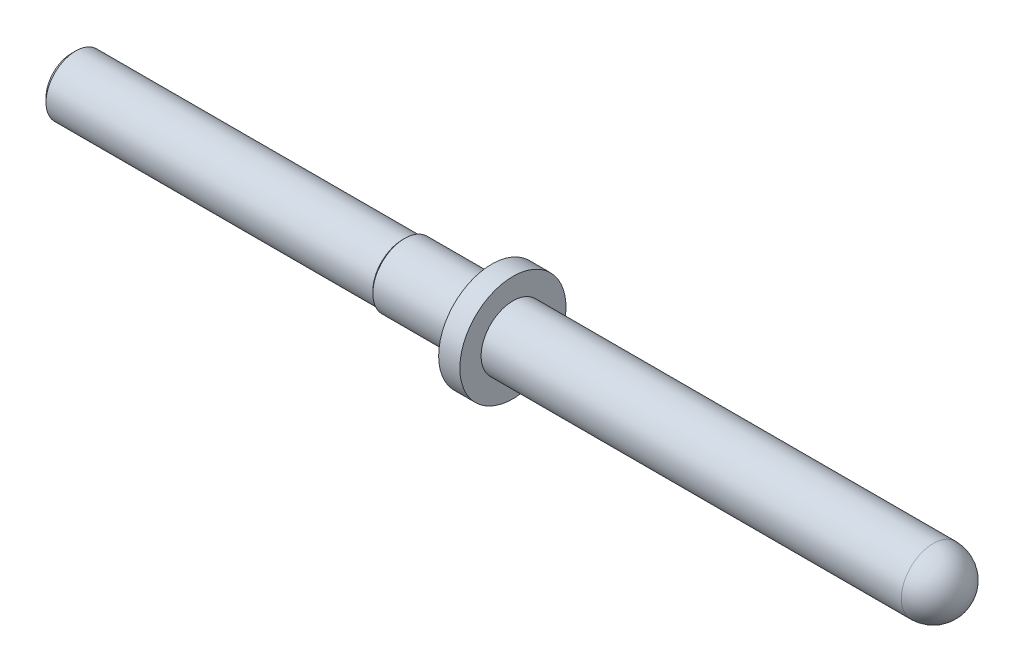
ISO-10303-21;
HEADER;
FILE_DESCRIPTION(('STEP AP214'),'2;1');
FILE_NAME('part.step','',(''),(''),'','','');
FILE_SCHEMA(('AUTOMOTIVE_DESIGN { 1 0 10303 214 1 1 1 1 }'));
ENDSEC;
DATA;
#1=APPLICATION_CONTEXT('core data for automotive mechanical design processes');
#2=APPLICATION_PROTOCOL_DEFINITION('international standard','automotive_design',2000,#1);
#3=PRODUCT_CONTEXT('',#1,'mechanical');
#4=PRODUCT('Part','Part','',(#3));
#5=PRODUCT_RELATED_PRODUCT_CATEGORY('part','',(#4));
#6=PRODUCT_DEFINITION_FORMATION('','',#4);
#7=PRODUCT_DEFINITION_CONTEXT('part definition',#1,'design');
#8=PRODUCT_DEFINITION('design','',#6,#7);
#9=PRODUCT_DEFINITION_SHAPE('','',#8);
#10=(LENGTH_UNIT() NAMED_UNIT(*) SI_UNIT(.MILLI.,.METRE.));
#11=(NAMED_UNIT(*) PLANE_ANGLE_UNIT() SI_UNIT($,.RADIAN.));
#12=(NAMED_UNIT(*) SI_UNIT($,.STERADIAN.) SOLID_ANGLE_UNIT());
#13=UNCERTAINTY_MEASURE_WITH_UNIT(LENGTH_MEASURE(1.E-05),#10,'distance_accuracy_value','');
#14=(GEOMETRIC_REPRESENTATION_CONTEXT(3) GLOBAL_UNCERTAINTY_ASSIGNED_CONTEXT((#13)) GLOBAL_UNIT_ASSIGNED_CONTEXT((#10,
#11,#12)) REPRESENTATION_CONTEXT('',''));
#15=CARTESIAN_POINT('',(0.,0.,0.));
#16=DIRECTION('',(0.,0.,1.));
#17=DIRECTION('',(1.,0.,0.));
#18=AXIS2_PLACEMENT_3D('',#15,#16,#17);
#19=CARTESIAN_POINT('',(0.,0.,0.));
#20=DIRECTION('',(1.,0.,0.));
#21=DIRECTION('',(0.,0.,-1.));
#22=AXIS2_PLACEMENT_3D('',#19,#20,#21);
#23=PLANE('',#22);
#24=CARTESIAN_POINT('',(0.,0.,0.));
#25=DIRECTION('',(1.,0.,0.));
#26=DIRECTION('',(0.,0.,-1.));
#27=AXIS2_PLACEMENT_3D('',#24,#25,#26);
#28=CIRCLE('',#27,0.599999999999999);
#29=CARTESIAN_POINT('',(0.,0.,-0.599999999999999));
#30=VERTEX_POINT('',#29);
#31=EDGE_CURVE('E38',#30,#30,#28,.F.);
#32=ORIENTED_EDGE('',*,*,#31,.T.);
#33=EDGE_LOOP('',(#32));
#34=FACE_BOUND('',#33,.T.);
#35=ADVANCED_FACE('F30',(#34),#23,.F.);
#36=CARTESIAN_POINT('',(0.,0.,0.));
#37=DIRECTION('',(-1.,0.,0.));
#38=DIRECTION('',(0.,0.,1.));
#39=AXIS2_PLACEMENT_3D('',#36,#37,#38);
#40=CYLINDRICAL_SURFACE('',#39,0.699999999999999);
#41=CARTESIAN_POINT('',(0.1,0.,0.));
#42=DIRECTION('',(1.,0.,0.));
#43=DIRECTION('',(0.,0.,-1.));
#44=AXIS2_PLACEMENT_3D('',#41,#42,#43);
#45=CIRCLE('',#44,0.699999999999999);
#46=CARTESIAN_POINT('',(0.1,0.,-0.699999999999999));
#47=VERTEX_POINT('',#46);
#48=EDGE_CURVE('E10',#47,#47,#45,.T.);
#49=ORIENTED_EDGE('',*,*,#48,.T.);
#50=EDGE_LOOP('',(#49));
#51=FACE_BOUND('',#50,.T.);
#52=CARTESIAN_POINT('',(7.8,0.,0.));
#53=DIRECTION('',(-1.,0.,0.));
#54=DIRECTION('',(0.,0.,1.));
#55=AXIS2_PLACEMENT_3D('',#52,#53,#54);
#56=CIRCLE('',#55,0.699999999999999);
#57=CARTESIAN_POINT('',(7.8,0.,0.699999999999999));
#58=VERTEX_POINT('',#57);
#59=EDGE_CURVE('E47',#58,#58,#56,.T.);
#60=ORIENTED_EDGE('',*,*,#59,.T.);
#61=EDGE_LOOP('',(#60));
#62=FACE_BOUND('',#61,.T.);
#63=ADVANCED_FACE('F81',(#51,#62),#40,.T.);
#64=CARTESIAN_POINT('',(0.,0.,0.));
#65=DIRECTION('',(-1.,0.,0.));
#66=DIRECTION('',(0.,0.,1.));
#67=AXIS2_PLACEMENT_3D('',#64,#65,#66);
#68=CYLINDRICAL_SURFACE('',#67,0.750000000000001);
#69=CARTESIAN_POINT('',(7.85,0.,0.));
#70=DIRECTION('',(1.,0.,0.));
#71=DIRECTION('',(0.,0.,-1.));
#72=AXIS2_PLACEMENT_3D('',#69,#70,#71);
#73=CIRCLE('',#72,0.750000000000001);
#74=CARTESIAN_POINT('',(7.85,0.,-0.750000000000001));
#75=VERTEX_POINT('',#74);
#76=EDGE_CURVE('E42',#75,#75,#73,.T.);
#77=ORIENTED_EDGE('',*,*,#76,.T.);
#78=EDGE_LOOP('',(#77));
#79=FACE_BOUND('',#78,.T.);
#80=CARTESIAN_POINT('',(9.9,0.,0.));
#81=DIRECTION('',(-1.,0.,0.));
#82=DIRECTION('',(0.,0.,1.));
#83=AXIS2_PLACEMENT_3D('',#80,#81,#82);
#84=CIRCLE('',#83,0.750000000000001);
#85=CARTESIAN_POINT('',(9.9,0.,0.750000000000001));
#86=VERTEX_POINT('',#85);
#87=EDGE_CURVE('E50',#86,#86,#84,.T.);
#88=ORIENTED_EDGE('',*,*,#87,.T.);
#89=EDGE_LOOP('',(#88));
#90=FACE_BOUND('',#89,.T.);
#91=ADVANCED_FACE('F86',(#79,#90),#68,.T.);
#92=CARTESIAN_POINT('',(9.9,0.750000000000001,0.));
#93=DIRECTION('',(1.,0.,0.));
#94=DIRECTION('',(0.,0.,-1.));
#95=AXIS2_PLACEMENT_3D('',#92,#93,#94);
#96=PLANE('',#95);
#97=ORIENTED_EDGE('',*,*,#87,.F.);
#98=EDGE_LOOP('',(#97));
#99=FACE_BOUND('',#98,.T.);
#100=CARTESIAN_POINT('',(9.9,0.,0.));
#101=DIRECTION('',(-1.,0.,0.));
#102=DIRECTION('',(0.,0.,1.));
#103=AXIS2_PLACEMENT_3D('',#100,#101,#102);
#104=CIRCLE('',#103,1.25);
#105=CARTESIAN_POINT('',(9.9,0.,1.25));
#106=VERTEX_POINT('',#105);
#107=EDGE_CURVE('E53',#106,#106,#104,.T.);
#108=ORIENTED_EDGE('',*,*,#107,.T.);
#109=EDGE_LOOP('',(#108));
#110=FACE_BOUND('',#109,.T.);
#111=ADVANCED_FACE('F91',(#99,#110),#96,.F.);
#112=CARTESIAN_POINT('',(0.,0.,0.));
#113=DIRECTION('',(-1.,0.,0.));
#114=DIRECTION('',(0.,0.,1.));
#115=AXIS2_PLACEMENT_3D('',#112,#113,#114);
#116=CYLINDRICAL_SURFACE('',#115,1.25);
#117=ORIENTED_EDGE('',*,*,#107,.F.);
#118=EDGE_LOOP('',(#117));
#119=FACE_BOUND('',#118,.T.);
#120=CARTESIAN_POINT('',(10.4,0.,0.));
#121=DIRECTION('',(-1.,0.,0.));
#122=DIRECTION('',(0.,0.,1.));
#123=AXIS2_PLACEMENT_3D('',#120,#121,#122);
#124=CIRCLE('',#123,1.25);
#125=CARTESIAN_POINT('',(10.4,0.,1.25));
#126=VERTEX_POINT('',#125);
#127=EDGE_CURVE('E56',#126,#126,#124,.T.);
#128=ORIENTED_EDGE('',*,*,#127,.T.);
#129=EDGE_LOOP('',(#128));
#130=FACE_BOUND('',#129,.T.);
#131=ADVANCED_FACE('F95',(#119,#130),#116,.T.);
#132=CARTESIAN_POINT('',(10.4,1.25,0.));
#133=DIRECTION('',(-1.,0.,0.));
#134=DIRECTION('',(0.,0.,1.));
#135=AXIS2_PLACEMENT_3D('',#132,#133,#134);
#136=PLANE('',#135);
#137=ORIENTED_EDGE('',*,*,#127,.F.);
#138=EDGE_LOOP('',(#137));
#139=FACE_BOUND('',#138,.T.);
#140=CARTESIAN_POINT('',(10.4,0.,0.));
#141=DIRECTION('',(-1.,0.,0.));
#142=DIRECTION('',(0.,0.,1.));
#143=AXIS2_PLACEMENT_3D('',#140,#141,#142);
#144=CIRCLE('',#143,0.750000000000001);
#145=CARTESIAN_POINT('',(10.4,0.,0.750000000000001));
#146=VERTEX_POINT('',#145);
#147=EDGE_CURVE('E59',#146,#146,#144,.T.);
#148=ORIENTED_EDGE('',*,*,#147,.T.);
#149=EDGE_LOOP('',(#148));
#150=FACE_BOUND('',#149,.T.);
#151=ADVANCED_FACE('F77',(#139,#150),#136,.F.);
#152=CARTESIAN_POINT('',(0.,0.,0.));
#153=DIRECTION('',(-1.,0.,0.));
#154=DIRECTION('',(0.,0.,1.));
#155=AXIS2_PLACEMENT_3D('',#152,#153,#154);
#156=CYLINDRICAL_SURFACE('',#155,0.750000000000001);
#157=ORIENTED_EDGE('',*,*,#147,.F.);
#158=EDGE_LOOP('',(#157));
#159=FACE_BOUND('',#158,.T.);
#160=CARTESIAN_POINT('',(20.3,0.,0.));
#161=DIRECTION('',(-1.,0.,0.));
#162=DIRECTION('',(0.,0.,1.));
#163=AXIS2_PLACEMENT_3D('',#160,#161,#162);
#164=CIRCLE('',#163,0.750000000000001);
#165=CARTESIAN_POINT('',(20.3,0.,0.750000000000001));
#166=VERTEX_POINT('',#165);
#167=EDGE_CURVE('E34',#166,#166,#164,.T.);
#168=ORIENTED_EDGE('',*,*,#167,.T.);
#169=EDGE_LOOP('',(#168));
#170=FACE_BOUND('',#169,.T.);
#171=ADVANCED_FACE('F66',(#159,#170),#156,.T.);
#172=CARTESIAN_POINT('',(20.3,0.,0.));
#173=DIRECTION('',(0.,0.,1.));
#174=DIRECTION('',(1.,0.,0.));
#175=AXIS2_PLACEMENT_3D('',#172,#173,#174);
#176=SPHERICAL_SURFACE('',#175,0.750000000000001);
#177=CARTESIAN_POINT('',(20.3,0.,0.));
#178=DIRECTION('',(-1.,0.,0.));
#179=DIRECTION('',(0.,0.,1.));
#180=AXIS2_PLACEMENT_3D('',#177,#178,#179);
#181=SPHERICAL_SURFACE('',#180,0.750000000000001);
#182=ORIENTED_EDGE('',*,*,#167,.F.);
#183=EDGE_LOOP('',(#182));
#184=FACE_BOUND('',#183,.T.);
#185=ADVANCED_FACE('F32',(#184),#181,.T.);
#186=CARTESIAN_POINT('',(7.8,0.,0.));
#187=DIRECTION('',(1.,0.,0.));
#188=DIRECTION('',(0.,0.,-1.));
#189=AXIS2_PLACEMENT_3D('',#186,#187,#188);
#190=CONICAL_SURFACE('',#189,0.7,0.785398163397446);
#191=ORIENTED_EDGE('',*,*,#76,.F.);
#192=EDGE_LOOP('',(#191));
#193=FACE_BOUND('',#192,.T.);
#194=ORIENTED_EDGE('',*,*,#59,.F.);
#195=EDGE_LOOP('',(#194));
#196=FACE_BOUND('',#195,.T.);
#197=ADVANCED_FACE('F69',(#193,#196),#190,.T.);
#198=CARTESIAN_POINT('',(0.,0.,0.));
#199=DIRECTION('',(1.,0.,0.));
#200=DIRECTION('',(0.,0.,-1.));
#201=AXIS2_PLACEMENT_3D('',#198,#199,#200);
#202=CONICAL_SURFACE('',#201,0.599999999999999,0.785398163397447);
#203=ORIENTED_EDGE('',*,*,#48,.F.);
#204=EDGE_LOOP('',(#203));
#205=FACE_BOUND('',#204,.T.);
#206=ORIENTED_EDGE('',*,*,#31,.F.);
#207=EDGE_LOOP('',(#206));
#208=FACE_BOUND('',#207,.T.);
#209=ADVANCED_FACE('F74',(#205,#208),#202,.T.);
#210=CLOSED_SHELL('',(#35,#63,#91,#111,#131,#151,#171,#185,#197,#209));
#211=MANIFOLD_SOLID_BREP('B2',#210);
#212=ADVANCED_BREP_SHAPE_REPRESENTATION('',(#18,#211),#14);
#213=SHAPE_DEFINITION_REPRESENTATION(#9,#212);
ENDSEC;
END-ISO-10303-21;
